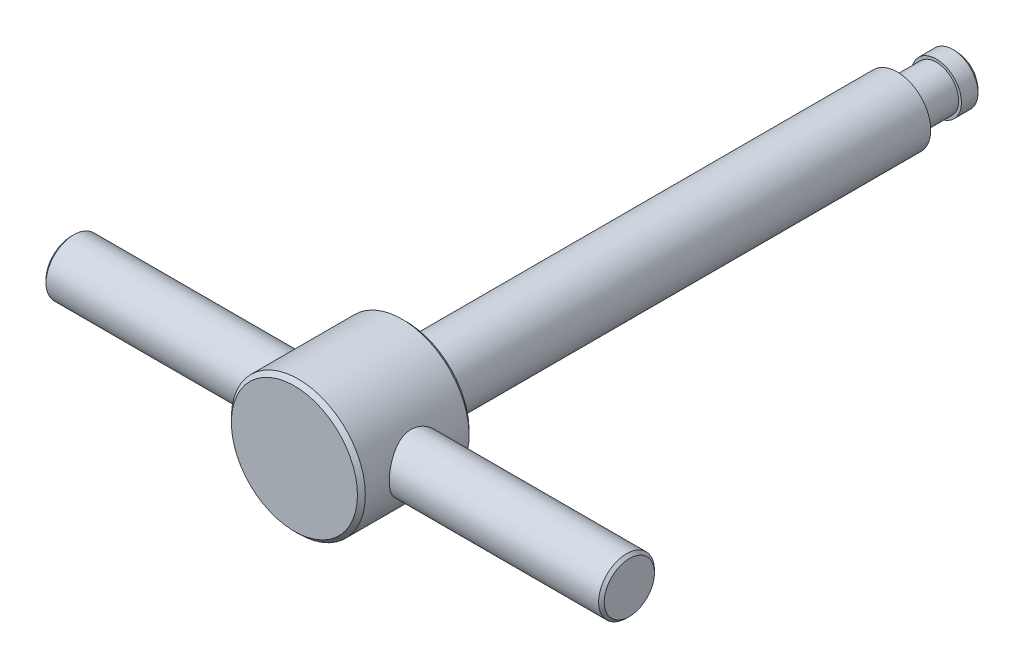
ISO-10303-21;
HEADER;
FILE_DESCRIPTION(('STEP AP214'),'2;1');
FILE_NAME('part.step','',(''),(''),'','','');
FILE_SCHEMA(('AUTOMOTIVE_DESIGN { 1 0 10303 214 1 1 1 1 }'));
ENDSEC;
DATA;
#1=APPLICATION_CONTEXT('core data for automotive mechanical design processes');
#2=APPLICATION_PROTOCOL_DEFINITION('international standard','automotive_design',2000,#1);
#3=PRODUCT_CONTEXT('',#1,'mechanical');
#4=PRODUCT('Part','Part','',(#3));
#5=PRODUCT_RELATED_PRODUCT_CATEGORY('part','',(#4));
#6=PRODUCT_DEFINITION_FORMATION('','',#4);
#7=PRODUCT_DEFINITION_CONTEXT('part definition',#1,'design');
#8=PRODUCT_DEFINITION('design','',#6,#7);
#9=PRODUCT_DEFINITION_SHAPE('','',#8);
#10=(LENGTH_UNIT() NAMED_UNIT(*) SI_UNIT(.MILLI.,.METRE.));
#11=(NAMED_UNIT(*) PLANE_ANGLE_UNIT() SI_UNIT($,.RADIAN.));
#12=(NAMED_UNIT(*) SI_UNIT($,.STERADIAN.) SOLID_ANGLE_UNIT());
#13=UNCERTAINTY_MEASURE_WITH_UNIT(LENGTH_MEASURE(1.E-05),#10,'distance_accuracy_value','');
#14=(GEOMETRIC_REPRESENTATION_CONTEXT(3) GLOBAL_UNCERTAINTY_ASSIGNED_CONTEXT((#13)) GLOBAL_UNIT_ASSIGNED_CONTEXT((#10,
#11,#12)) REPRESENTATION_CONTEXT('',''));
#15=CARTESIAN_POINT('',(0.,0.,0.));
#16=DIRECTION('',(0.,0.,1.));
#17=DIRECTION('',(1.,0.,0.));
#18=AXIS2_PLACEMENT_3D('',#15,#16,#17);
#19=CARTESIAN_POINT('',(25.,0.,57.25));
#20=DIRECTION('',(-1.,0.,0.));
#21=DIRECTION('',(0.,-1.,0.));
#22=AXIS2_PLACEMENT_3D('',#19,#20,#21);
#23=PLANE('',#22);
#24=CARTESIAN_POINT('',(25.0000000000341,0.,55.));
#25=DIRECTION('',(-1.,0.,0.));
#26=DIRECTION('',(0.,-1.,0.));
#27=AXIS2_PLACEMENT_3D('',#24,#25,#26);
#28=CIRCLE('',#27,2.25000000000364);
#29=CARTESIAN_POINT('',(25.0000000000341,-2.25000000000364,55.));
#30=VERTEX_POINT('',#29);
#31=EDGE_CURVE('E15',#30,#30,#28,.T.);
#32=ORIENTED_EDGE('',*,*,#31,.F.);
#33=EDGE_LOOP('',(#32));
#34=FACE_BOUND('',#33,.T.);
#35=ADVANCED_FACE('F12',(#34),#23,.F.);
#36=CARTESIAN_POINT('',(-25.,0.,55.));
#37=DIRECTION('',(1.,0.,0.));
#38=DIRECTION('',(0.,1.,0.));
#39=AXIS2_PLACEMENT_3D('',#36,#37,#38);
#40=PLANE('',#39);
#41=CARTESIAN_POINT('',(-24.9999999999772,0.,55.));
#42=DIRECTION('',(1.,0.,0.));
#43=DIRECTION('',(0.,0.,1.));
#44=AXIS2_PLACEMENT_3D('',#41,#42,#43);
#45=CIRCLE('',#44,2.25000000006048);
#46=CARTESIAN_POINT('',(-24.9999999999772,0.,57.2500000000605));
#47=VERTEX_POINT('',#46);
#48=EDGE_CURVE('E133',#47,#47,#45,.T.);
#49=ORIENTED_EDGE('',*,*,#48,.F.);
#50=EDGE_LOOP('',(#49));
#51=FACE_BOUND('',#50,.T.);
#52=ADVANCED_FACE('F171',(#51),#40,.F.);
#53=CARTESIAN_POINT('',(0.,0.,3.));
#54=DIRECTION('',(-1.,0.,0.));
#55=DIRECTION('',(0.,1.,0.));
#56=AXIS2_PLACEMENT_3D('',#53,#54,#55);
#57=SPHERICAL_SURFACE('',#56,3.);
#58=CARTESIAN_POINT('',(0.,0.,1.01568651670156));
#59=DIRECTION('',(0.,0.,1.));
#60=DIRECTION('',(0.,-1.,0.));
#61=AXIS2_PLACEMENT_3D('',#58,#59,#60);
#62=CIRCLE('',#61,2.25);
#63=CARTESIAN_POINT('',(0.,-2.25,1.01568651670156));
#64=VERTEX_POINT('',#63);
#65=EDGE_CURVE('E126',#64,#64,#62,.T.);
#66=ORIENTED_EDGE('',*,*,#65,.F.);
#67=EDGE_LOOP('',(#66));
#68=FACE_BOUND('',#67,.T.);
#69=ADVANCED_FACE('F168',(#68),#57,.T.);
#70=CARTESIAN_POINT('',(24.7499999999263,0.,55.));
#71=DIRECTION('',(-1.,0.,0.));
#72=DIRECTION('',(0.,-1.,0.));
#73=AXIS2_PLACEMENT_3D('',#70,#71,#72);
#74=CONICAL_SURFACE('',#73,2.50000000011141,0.785398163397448);
#75=CARTESIAN_POINT('',(24.75,0.,55.));
#76=DIRECTION('',(-1.,0.,0.));
#77=DIRECTION('',(0.,-1.,0.));
#78=AXIS2_PLACEMENT_3D('',#75,#76,#77);
#79=CIRCLE('',#78,2.5);
#80=CARTESIAN_POINT('',(24.75,-2.5,55.));
#81=VERTEX_POINT('',#80);
#82=EDGE_CURVE('E124',#81,#81,#79,.T.);
#83=ORIENTED_EDGE('',*,*,#82,.F.);
#84=EDGE_LOOP('',(#83));
#85=FACE_BOUND('',#84,.T.);
#86=ORIENTED_EDGE('',*,*,#31,.T.);
#87=EDGE_LOOP('',(#86));
#88=FACE_BOUND('',#87,.T.);
#89=ADVANCED_FACE('F164',(#85,#88),#74,.T.);
#90=CARTESIAN_POINT('',(0.,0.,60.));
#91=DIRECTION('',(0.,0.,-1.));
#92=DIRECTION('',(0.,1.,0.));
#93=AXIS2_PLACEMENT_3D('',#90,#91,#92);
#94=PLANE('',#93);
#95=CARTESIAN_POINT('',(0.,0.,59.9999999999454));
#96=DIRECTION('',(0.,0.,-1.));
#97=DIRECTION('',(1.,0.,0.));
#98=AXIS2_PLACEMENT_3D('',#95,#96,#97);
#99=CIRCLE('',#98,5.64644660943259);
#100=CARTESIAN_POINT('',(5.64644660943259,0.,59.9999999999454));
#101=VERTEX_POINT('',#100);
#102=EDGE_CURVE('E121',#101,#101,#99,.T.);
#103=ORIENTED_EDGE('',*,*,#102,.F.);
#104=EDGE_LOOP('',(#103));
#105=FACE_BOUND('',#104,.T.);
#106=ADVANCED_FACE('F160',(#105),#94,.F.);
#107=CARTESIAN_POINT('',(-24.7499999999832,0.,55.));
#108=DIRECTION('',(1.,0.,0.));
#109=DIRECTION('',(0.,0.,1.));
#110=AXIS2_PLACEMENT_3D('',#107,#108,#109);
#111=CONICAL_SURFACE('',#110,2.50000000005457,0.785398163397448);
#112=ORIENTED_EDGE('',*,*,#48,.T.);
#113=EDGE_LOOP('',(#112));
#114=FACE_BOUND('',#113,.T.);
#115=CARTESIAN_POINT('',(-24.75,0.,55.));
#116=DIRECTION('',(-1.,0.,0.));
#117=DIRECTION('',(0.,-1.,0.));
#118=AXIS2_PLACEMENT_3D('',#115,#116,#117);
#119=CIRCLE('',#118,2.5);
#120=CARTESIAN_POINT('',(-24.75,-2.5,55.));
#121=VERTEX_POINT('',#120);
#122=EDGE_CURVE('E117',#121,#121,#119,.F.);
#123=ORIENTED_EDGE('',*,*,#122,.F.);
#124=EDGE_LOOP('',(#123));
#125=FACE_BOUND('',#124,.T.);
#126=ADVANCED_FACE('F154',(#114,#125),#111,.T.);
#127=CARTESIAN_POINT('',(0.,0.,0.));
#128=DIRECTION('',(0.,0.,1.));
#129=DIRECTION('',(0.,-1.,0.));
#130=AXIS2_PLACEMENT_3D('',#127,#128,#129);
#131=CYLINDRICAL_SURFACE('',#130,2.25);
#132=CARTESIAN_POINT('',(0.,0.,2.5));
#133=DIRECTION('',(0.,0.,1.));
#134=DIRECTION('',(0.,-1.,0.));
#135=AXIS2_PLACEMENT_3D('',#132,#133,#134);
#136=CIRCLE('',#135,2.25);
#137=CARTESIAN_POINT('',(0.,-2.25,2.5));
#138=VERTEX_POINT('',#137);
#139=EDGE_CURVE('E120',#138,#138,#136,.F.);
#140=ORIENTED_EDGE('',*,*,#139,.T.);
#141=EDGE_LOOP('',(#140));
#142=FACE_BOUND('',#141,.T.);
#143=ORIENTED_EDGE('',*,*,#65,.T.);
#144=EDGE_LOOP('',(#143));
#145=FACE_BOUND('',#144,.T.);
#146=ADVANCED_FACE('F147',(#142,#145),#131,.T.);
#147=CARTESIAN_POINT('',(25.,0.,55.));
#148=DIRECTION('',(-1.,0.,0.));
#149=DIRECTION('',(0.,-1.,0.));
#150=AXIS2_PLACEMENT_3D('',#147,#148,#149);
#151=CYLINDRICAL_SURFACE('',#150,2.5);
#152=CARTESIAN_POINT('',(5.45579342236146,2.49686165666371,54.8747727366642));
#153=CARTESIAN_POINT('',(5.4573407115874,2.49348212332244,54.807420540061));
#154=CARTESIAN_POINT('',(5.46013427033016,2.48737499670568,54.7402107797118));
#155=CARTESIAN_POINT('',(5.46811434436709,2.46977965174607,54.6066293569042));
#156=CARTESIAN_POINT('',(5.47330241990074,2.45828792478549,54.5402582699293));
#157=CARTESIAN_POINT('',(5.49224376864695,2.41583552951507,54.3428594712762));
#158=CARTESIAN_POINT('',(5.50936824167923,2.37690915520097,54.2137675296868));
#159=CARTESIAN_POINT('',(5.55031554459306,2.27963408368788,53.96507761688));
#160=CARTESIAN_POINT('',(5.57410899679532,2.22137036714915,53.8454408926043));
#161=CARTESIAN_POINT('',(5.6257284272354,2.08718411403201,53.6175612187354));
#162=CARTESIAN_POINT('',(5.65355320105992,2.01126684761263,53.5093148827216));
#163=CARTESIAN_POINT('',(5.71212107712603,1.838599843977,53.3002953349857));
#164=CARTESIAN_POINT('',(5.74293951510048,1.74088566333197,53.2003391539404));
#165=CARTESIAN_POINT('',(5.80272734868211,1.52982934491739,53.0178063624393));
#166=CARTESIAN_POINT('',(5.83169618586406,1.41648251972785,52.935234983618));
#167=CARTESIAN_POINT('',(5.88545947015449,1.1735507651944,52.7878805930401));
#168=CARTESIAN_POINT('',(5.91012490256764,1.04361863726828,52.7236193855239));
#169=CARTESIAN_POINT('',(5.95149690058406,0.773502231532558,52.618261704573));
#170=CARTESIAN_POINT('',(5.96820776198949,0.633323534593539,52.5771527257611));
#171=CARTESIAN_POINT('',(5.9909398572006,0.35605350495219,52.521703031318));
#172=CARTESIAN_POINT('',(5.99756148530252,0.219312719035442,52.5058559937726));
#173=CARTESIAN_POINT('',(6.00131386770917,-0.0550255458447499,52.4968437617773));
#174=CARTESIAN_POINT('',(5.99844751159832,-0.192622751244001,52.5036716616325));
#175=CARTESIAN_POINT('',(5.98393790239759,-0.457365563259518,52.5387520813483));
#176=CARTESIAN_POINT('',(5.97274986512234,-0.584686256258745,52.5658938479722));
#177=CARTESIAN_POINT('',(5.94323412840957,-0.832820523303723,52.639246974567));
#178=CARTESIAN_POINT('',(5.92490555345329,-0.953633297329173,52.6854606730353));
#179=CARTESIAN_POINT('',(5.88219611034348,-1.18934663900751,52.7970564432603));
#180=CARTESIAN_POINT('',(5.85765314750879,-1.30396896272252,52.8629621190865));
#181=CARTESIAN_POINT('',(5.80510670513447,-1.5209261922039,53.0115115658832));
#182=CARTESIAN_POINT('',(5.77710180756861,-1.62325602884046,53.0941622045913));
#183=CARTESIAN_POINT('',(5.7181615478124,-1.82042970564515,53.2807700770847));
#184=CARTESIAN_POINT('',(5.68715988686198,-1.91421389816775,53.3858287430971));
#185=CARTESIAN_POINT('',(5.62748515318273,-2.08313617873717,53.6106412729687));
#186=CARTESIAN_POINT('',(5.5988126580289,-2.158269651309,53.7303987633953));
#187=CARTESIAN_POINT('',(5.5467737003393,-2.28874133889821,53.983972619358));
#188=CARTESIAN_POINT('',(5.52350201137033,-2.34373455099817,54.1179874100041));
#189=CARTESIAN_POINT('',(5.48614157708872,-2.42991688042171,54.3946484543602));
#190=CARTESIAN_POINT('',(5.47204533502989,-2.46112543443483,54.5372875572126));
#191=CARTESIAN_POINT('',(5.45584469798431,-2.49681994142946,54.8154885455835));
#192=CARTESIAN_POINT('',(5.4529112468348,-2.50315453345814,54.9507657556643));
#193=CARTESIAN_POINT('',(5.45714355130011,-2.49391503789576,55.2203941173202));
#194=CARTESIAN_POINT('',(5.46430755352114,-2.47834475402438,55.354745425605));
#195=CARTESIAN_POINT('',(5.48715188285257,-2.42731941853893,55.6119498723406));
#196=CARTESIAN_POINT('',(5.50240078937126,-2.39286895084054,55.735044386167));
#197=CARTESIAN_POINT('',(5.53933217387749,-2.30608126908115,55.9737173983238));
#198=CARTESIAN_POINT('',(5.56101634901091,-2.25373933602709,56.0892939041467));
#199=CARTESIAN_POINT('',(5.60994281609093,-2.12914601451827,56.3170249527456));
#200=CARTESIAN_POINT('',(5.63743552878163,-2.05591142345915,56.4285866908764));
#201=CARTESIAN_POINT('',(5.69422833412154,-1.89293576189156,56.6384323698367));
#202=CARTESIAN_POINT('',(5.72352923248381,-1.80318729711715,56.7367103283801));
#203=CARTESIAN_POINT('',(5.78324662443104,-1.60183297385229,56.9247009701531));
#204=CARTESIAN_POINT('',(5.81358445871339,-1.48909911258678,57.0132361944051));
#205=CARTESIAN_POINT('',(5.86977338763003,-1.24935837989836,57.170165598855));
#206=CARTESIAN_POINT('',(5.89562488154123,-1.12235278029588,57.238561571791));
#207=CARTESIAN_POINT('',(5.93960982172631,-0.859369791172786,57.3519483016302));
#208=CARTESIAN_POINT('',(5.957855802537,-0.723560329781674,57.3972826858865));
#209=CARTESIAN_POINT('',(5.98507884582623,-0.445333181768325,57.4641664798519));
#210=CARTESIAN_POINT('',(5.9940612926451,-0.302919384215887,57.4857297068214));
#211=CARTESIAN_POINT('',(6.00141926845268,-0.0265470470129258,57.5034141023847));
#212=CARTESIAN_POINT('',(6.00050937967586,0.107285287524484,57.5012491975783));
#213=CARTESIAN_POINT('',(5.9898940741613,0.37253240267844,57.4756750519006));
#214=CARTESIAN_POINT('',(5.9801894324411,0.503947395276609,57.4522676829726));
#215=CARTESIAN_POINT('',(5.95328590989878,0.757865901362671,57.3858967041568));
#216=CARTESIAN_POINT('',(5.9362510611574,0.880499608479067,57.3433602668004));
#217=CARTESIAN_POINT('',(5.89634089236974,1.11694067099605,57.2403317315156));
#218=CARTESIAN_POINT('',(5.87346418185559,1.23074591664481,57.1798353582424));
#219=CARTESIAN_POINT('',(5.82254236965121,1.45318208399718,57.0387641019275));
#220=CARTESIAN_POINT('',(5.79428057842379,1.56117318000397,56.9572596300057));
#221=CARTESIAN_POINT('',(5.73626589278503,1.76245406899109,56.7781790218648));
#222=CARTESIAN_POINT('',(5.70651242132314,1.85573811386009,56.6805966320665));
#223=CARTESIAN_POINT('',(5.64665744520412,2.03084981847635,56.4649560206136));
#224=CARTESIAN_POINT('',(5.6166475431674,2.11161682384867,56.346006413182));
#225=CARTESIAN_POINT('',(5.56184611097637,2.25201465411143,56.095042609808));
#226=CARTESIAN_POINT('',(5.53705640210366,2.31163810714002,55.9630238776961));
#227=CARTESIAN_POINT('',(5.4965798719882,2.40629255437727,55.6926166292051));
#228=CARTESIAN_POINT('',(5.48068775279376,2.44188246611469,55.5544588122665));
#229=CARTESIAN_POINT('',(5.46473916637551,2.47724918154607,55.343969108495));
#230=CARTESIAN_POINT('',(5.46073796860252,2.48603523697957,55.2733305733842));
#231=CARTESIAN_POINT('',(5.45548244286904,2.49755101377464,55.1314756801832));
#232=CARTESIAN_POINT('',(5.45422615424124,2.50028505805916,55.060259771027));
#233=CARTESIAN_POINT('',(5.45444241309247,2.49981071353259,54.9509592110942));
#234=CARTESIAN_POINT('',(5.4549188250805,2.49877192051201,54.9128432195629));
#235=CARTESIAN_POINT('',(5.45579342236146,2.49686165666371,54.8747727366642));
#236=B_SPLINE_CURVE_WITH_KNOTS('',3,(#152,#153,#154,#155,#156,#157,#158,#159,#160,#161,#162,
#163,#164,#165,#166,#167,#168,#169,#170,#171,#172,#173,#174,#175,#176,#177,#178,#179,#180,#181,
#182,#183,#184,#185,#186,#187,#188,#189,#190,#191,#192,#193,#194,#195,#196,#197,#198,#199,#200,
#201,#202,#203,#204,#205,#206,#207,#208,#209,#210,#211,#212,#213,#214,#215,#216,#217,#218,#219,
#220,#221,#222,#223,#224,#225,#226,#227,#228,#229,#230,#231,#232,#233,#234,#235),.UNSPECIFIED.,
.T.,.F.,(4,2,2,2,2,2,2,2,2,2,2,2,2,2,2,2,2,2,2,2,2,2,2,2,2,2,2,2,2,2,2,2,2,2,2,2,2,2,2,2,2,4),
(0.,0.202330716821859,0.404793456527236,0.810374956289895,1.2141971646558,1.61789897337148,
2.04540544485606,2.47304038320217,2.91186134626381,3.35044505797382,3.76174116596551,
4.1729120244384,4.56310688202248,4.95334959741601,5.35506542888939,5.75694635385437,
6.18758470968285,6.61832952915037,7.05614152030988,7.49359534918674,7.89784284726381,
8.30202015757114,8.68652786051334,9.07113705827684,9.47817972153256,9.88540508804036,
10.3228612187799,10.7602783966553,11.1909715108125,11.6214141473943,12.0209827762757,
12.4205161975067,12.8115394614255,13.202655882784,13.6155254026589,14.0285558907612,
14.4670464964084,14.9056898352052,15.3337443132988,15.547376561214,15.7608561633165,
15.8752225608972),.UNSPECIFIED.);
#237=CARTESIAN_POINT('',(5.45579342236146,2.49686165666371,54.8747727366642));
#238=VERTEX_POINT('',#237);
#239=EDGE_CURVE('E46',#238,#238,#236,.T.);
#240=ORIENTED_EDGE('',*,*,#239,.F.);
#241=EDGE_LOOP('',(#240));
#242=FACE_BOUND('',#241,.T.);
#243=ORIENTED_EDGE('',*,*,#82,.T.);
#244=EDGE_LOOP('',(#243));
#245=FACE_BOUND('',#244,.T.);
#246=ADVANCED_FACE('F145',(#242,#245),#151,.T.);
#247=CARTESIAN_POINT('',(0.,0.,59.6464466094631));
#248=DIRECTION('',(0.,0.,-1.));
#249=DIRECTION('',(1.,0.,0.));
#250=AXIS2_PLACEMENT_3D('',#247,#248,#249);
#251=CONICAL_SURFACE('',#250,5.99999999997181,0.785398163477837);
#252=ORIENTED_EDGE('',*,*,#102,.T.);
#253=EDGE_LOOP('',(#252));
#254=FACE_BOUND('',#253,.T.);
#255=CARTESIAN_POINT('',(0.,0.,59.6464466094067));
#256=DIRECTION('',(0.,0.,1.));
#257=DIRECTION('',(0.,-1.,0.));
#258=AXIS2_PLACEMENT_3D('',#255,#256,#257);
#259=CIRCLE('',#258,6.);
#260=CARTESIAN_POINT('',(0.,-6.,59.6464466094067));
#261=VERTEX_POINT('',#260);
#262=EDGE_CURVE('E45',#261,#261,#259,.F.);
#263=ORIENTED_EDGE('',*,*,#262,.F.);
#264=EDGE_LOOP('',(#263));
#265=FACE_BOUND('',#264,.T.);
#266=ADVANCED_FACE('F72',(#254,#265),#251,.T.);
#267=CARTESIAN_POINT('',(25.,0.,55.));
#268=DIRECTION('',(-1.,0.,0.));
#269=DIRECTION('',(0.,-1.,0.));
#270=AXIS2_PLACEMENT_3D('',#267,#268,#269);
#271=CYLINDRICAL_SURFACE('',#270,2.5);
#272=ORIENTED_EDGE('',*,*,#122,.T.);
#273=EDGE_LOOP('',(#272));
#274=FACE_BOUND('',#273,.T.);
#275=CARTESIAN_POINT('',(-5.45579342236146,2.49686165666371,55.1252272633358));
#276=CARTESIAN_POINT('',(-5.4573407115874,2.49348212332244,55.192579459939));
#277=CARTESIAN_POINT('',(-5.46013427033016,2.48737499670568,55.2597892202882));
#278=CARTESIAN_POINT('',(-5.4681143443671,2.46977965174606,55.3933706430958));
#279=CARTESIAN_POINT('',(-5.47330241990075,2.45828792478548,55.4597417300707));
#280=CARTESIAN_POINT('',(-5.49224376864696,2.41583552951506,55.6571405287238));
#281=CARTESIAN_POINT('',(-5.50936824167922,2.37690915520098,55.7862324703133));
#282=CARTESIAN_POINT('',(-5.55031554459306,2.27963408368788,56.03492238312));
#283=CARTESIAN_POINT('',(-5.57410899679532,2.22137036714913,56.1545591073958));
#284=CARTESIAN_POINT('',(-5.6257284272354,2.08718411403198,56.3824387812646));
#285=CARTESIAN_POINT('',(-5.65355320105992,2.01126684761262,56.4906851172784));
#286=CARTESIAN_POINT('',(-5.71212107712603,1.83859984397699,56.6997046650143));
#287=CARTESIAN_POINT('',(-5.74293951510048,1.74088566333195,56.7996608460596));
#288=CARTESIAN_POINT('',(-5.80272734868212,1.52982934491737,56.9821936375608));
#289=CARTESIAN_POINT('',(-5.83169618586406,1.41648251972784,57.0647650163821));
#290=CARTESIAN_POINT('',(-5.88545947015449,1.1735507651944,57.21211940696));
#291=CARTESIAN_POINT('',(-5.91012490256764,1.04361863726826,57.2763806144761));
#292=CARTESIAN_POINT('',(-5.95149690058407,0.773502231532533,57.381738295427));
#293=CARTESIAN_POINT('',(-5.96820776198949,0.633323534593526,57.4228472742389));
#294=CARTESIAN_POINT('',(-5.9909398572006,0.356053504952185,57.478296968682));
#295=CARTESIAN_POINT('',(-5.99756148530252,0.219312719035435,57.4941440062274));
#296=CARTESIAN_POINT('',(-6.00131386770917,-0.0550255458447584,57.5031562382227));
#297=CARTESIAN_POINT('',(-5.99844751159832,-0.192622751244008,57.4963283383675));
#298=CARTESIAN_POINT('',(-5.98393790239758,-0.457365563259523,57.4612479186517));
#299=CARTESIAN_POINT('',(-5.97274986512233,-0.58468625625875,57.4341061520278));
#300=CARTESIAN_POINT('',(-5.94323412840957,-0.832820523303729,57.360753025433));
#301=CARTESIAN_POINT('',(-5.92490555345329,-0.95363329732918,57.3145393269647));
#302=CARTESIAN_POINT('',(-5.88219611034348,-1.18934663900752,57.2029435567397));
#303=CARTESIAN_POINT('',(-5.85765314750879,-1.30396896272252,57.1370378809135));
#304=CARTESIAN_POINT('',(-5.80510670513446,-1.5209261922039,56.9884884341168));
#305=CARTESIAN_POINT('',(-5.77710180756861,-1.62325602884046,56.9058377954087));
#306=CARTESIAN_POINT('',(-5.71816154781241,-1.82042970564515,56.7192299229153));
#307=CARTESIAN_POINT('',(-5.68715988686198,-1.91421389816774,56.6141712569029));
#308=CARTESIAN_POINT('',(-5.62748515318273,-2.08313617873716,56.3893587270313));
#309=CARTESIAN_POINT('',(-5.5988126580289,-2.158269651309,56.2696012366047));
#310=CARTESIAN_POINT('',(-5.5467737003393,-2.28874133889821,56.016027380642));
#311=CARTESIAN_POINT('',(-5.52350201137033,-2.34373455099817,55.8820125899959));
#312=CARTESIAN_POINT('',(-5.48614157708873,-2.42991688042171,55.6053515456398));
#313=CARTESIAN_POINT('',(-5.47204533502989,-2.46112543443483,55.4627124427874));
#314=CARTESIAN_POINT('',(-5.45584469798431,-2.49681994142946,55.1845114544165));
#315=CARTESIAN_POINT('',(-5.4529112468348,-2.50315453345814,55.0492342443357));
#316=CARTESIAN_POINT('',(-5.45714355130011,-2.49391503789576,54.7796058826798));
#317=CARTESIAN_POINT('',(-5.46430755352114,-2.47834475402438,54.645254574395));
#318=CARTESIAN_POINT('',(-5.48715188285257,-2.42731941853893,54.3880501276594));
#319=CARTESIAN_POINT('',(-5.50240078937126,-2.39286895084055,54.264955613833));
#320=CARTESIAN_POINT('',(-5.53933217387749,-2.30608126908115,54.0262826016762));
#321=CARTESIAN_POINT('',(-5.56101634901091,-2.25373933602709,53.9107060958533));
#322=CARTESIAN_POINT('',(-5.60994281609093,-2.12914601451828,53.6829750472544));
#323=CARTESIAN_POINT('',(-5.63743552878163,-2.05591142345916,53.5714133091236));
#324=CARTESIAN_POINT('',(-5.69422833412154,-1.89293576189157,53.3615676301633));
#325=CARTESIAN_POINT('',(-5.72352923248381,-1.80318729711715,53.2632896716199));
#326=CARTESIAN_POINT('',(-5.78324662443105,-1.60183297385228,53.0752990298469));
#327=CARTESIAN_POINT('',(-5.81358445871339,-1.48909911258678,52.9867638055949));
#328=CARTESIAN_POINT('',(-5.86977338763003,-1.24935837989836,52.829834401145));
#329=CARTESIAN_POINT('',(-5.89562488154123,-1.12235278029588,52.761438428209));
#330=CARTESIAN_POINT('',(-5.93960982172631,-0.859369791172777,52.6480516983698));
#331=CARTESIAN_POINT('',(-5.95785580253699,-0.723560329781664,52.6027173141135));
#332=CARTESIAN_POINT('',(-5.98507884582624,-0.445333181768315,52.5358335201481));
#333=CARTESIAN_POINT('',(-5.99406129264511,-0.302919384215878,52.5142702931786));
#334=CARTESIAN_POINT('',(-6.00141926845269,-0.0265470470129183,52.4965858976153));
#335=CARTESIAN_POINT('',(-6.00050937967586,0.107285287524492,52.4987508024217));
#336=CARTESIAN_POINT('',(-5.9898940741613,0.372532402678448,52.5243249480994));
#337=CARTESIAN_POINT('',(-5.9801894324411,0.503947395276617,52.5477323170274));
#338=CARTESIAN_POINT('',(-5.95328590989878,0.757865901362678,52.6141032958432));
#339=CARTESIAN_POINT('',(-5.9362510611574,0.880499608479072,52.6566397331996));
#340=CARTESIAN_POINT('',(-5.89634089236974,1.11694067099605,52.7596682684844));
#341=CARTESIAN_POINT('',(-5.87346418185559,1.23074591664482,52.8201646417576));
#342=CARTESIAN_POINT('',(-5.82254236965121,1.45318208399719,52.9612358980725));
#343=CARTESIAN_POINT('',(-5.79428057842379,1.56117318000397,53.0427403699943));
#344=CARTESIAN_POINT('',(-5.73626589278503,1.76245406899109,53.2218209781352));
#345=CARTESIAN_POINT('',(-5.70651242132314,1.85573811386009,53.3194033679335));
#346=CARTESIAN_POINT('',(-5.64665744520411,2.03084981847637,53.5350439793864));
#347=CARTESIAN_POINT('',(-5.6166475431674,2.1116168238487,53.653993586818));
#348=CARTESIAN_POINT('',(-5.56184611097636,2.25201465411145,53.904957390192));
#349=CARTESIAN_POINT('',(-5.53705640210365,2.31163810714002,54.036976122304));
#350=CARTESIAN_POINT('',(-5.4965798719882,2.40629255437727,54.307383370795));
#351=CARTESIAN_POINT('',(-5.48068775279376,2.4418824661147,54.4455411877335));
#352=CARTESIAN_POINT('',(-5.4647391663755,2.47724918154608,54.6560308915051));
#353=CARTESIAN_POINT('',(-5.46073796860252,2.48603523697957,54.7266694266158));
#354=CARTESIAN_POINT('',(-5.45548244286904,2.49755101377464,54.8685243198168));
#355=CARTESIAN_POINT('',(-5.45422615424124,2.50028505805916,54.9397402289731));
#356=CARTESIAN_POINT('',(-5.45444241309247,2.49981071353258,55.0490407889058));
#357=CARTESIAN_POINT('',(-5.4549188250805,2.49877192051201,55.0871567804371));
#358=CARTESIAN_POINT('',(-5.45579342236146,2.49686165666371,55.1252272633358));
#359=B_SPLINE_CURVE_WITH_KNOTS('',3,(#275,#276,#277,#278,#279,#280,#281,#282,#283,#284,#285,
#286,#287,#288,#289,#290,#291,#292,#293,#294,#295,#296,#297,#298,#299,#300,#301,#302,#303,#304,
#305,#306,#307,#308,#309,#310,#311,#312,#313,#314,#315,#316,#317,#318,#319,#320,#321,#322,#323,
#324,#325,#326,#327,#328,#329,#330,#331,#332,#333,#334,#335,#336,#337,#338,#339,#340,#341,#342,
#343,#344,#345,#346,#347,#348,#349,#350,#351,#352,#353,#354,#355,#356,#357,#358),.UNSPECIFIED.,
.T.,.F.,(4,2,2,2,2,2,2,2,2,2,2,2,2,2,2,2,2,2,2,2,2,2,2,2,2,2,2,2,2,2,2,2,2,2,2,2,2,2,2,2,2,4),
(0.,0.20233071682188,0.404793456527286,0.810374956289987,1.21419716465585,1.61789897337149,
2.0454054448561,2.47304038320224,2.91186134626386,3.35044505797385,3.76174116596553,
4.17291202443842,4.5631068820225,4.95334959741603,5.35506542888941,5.75694635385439,
6.18758470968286,6.61832952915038,7.05614152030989,7.49359534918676,7.89784284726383,
8.30202015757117,8.68652786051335,9.07113705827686,9.47817972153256,9.88540508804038,
10.3228612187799,10.7602783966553,11.1909715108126,11.6214141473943,12.0209827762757,
12.4205161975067,12.8115394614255,13.202655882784,13.6155254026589,14.0285558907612,
14.4670464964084,14.9056898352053,15.3337443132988,15.547376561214,15.7608561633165,
15.8752225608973),.UNSPECIFIED.);
#360=CARTESIAN_POINT('',(-5.45579342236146,2.49686165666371,55.1252272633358));
#361=VERTEX_POINT('',#360);
#362=EDGE_CURVE('E37',#361,#361,#359,.T.);
#363=ORIENTED_EDGE('',*,*,#362,.F.);
#364=EDGE_LOOP('',(#363));
#365=FACE_BOUND('',#364,.T.);
#366=ADVANCED_FACE('F52',(#274,#365),#271,.T.);
#367=CARTESIAN_POINT('',(2.,0.,2.5));
#368=DIRECTION('',(0.,0.,-1.));
#369=DIRECTION('',(0.,1.,0.));
#370=AXIS2_PLACEMENT_3D('',#367,#368,#369);
#371=PLANE('',#370);
#372=CARTESIAN_POINT('',(0.,0.,2.5));
#373=DIRECTION('',(0.,0.,1.));
#374=DIRECTION('',(0.,-1.,0.));
#375=AXIS2_PLACEMENT_3D('',#372,#373,#374);
#376=CIRCLE('',#375,2.);
#377=CARTESIAN_POINT('',(0.,-2.,2.5));
#378=VERTEX_POINT('',#377);
#379=EDGE_CURVE('E33',#378,#378,#376,.T.);
#380=ORIENTED_EDGE('',*,*,#379,.F.);
#381=EDGE_LOOP('',(#380));
#382=FACE_BOUND('',#381,.T.);
#383=ORIENTED_EDGE('',*,*,#139,.F.);
#384=EDGE_LOOP('',(#383));
#385=FACE_BOUND('',#384,.T.);
#386=ADVANCED_FACE('F61',(#382,#385),#371,.F.);
#387=CARTESIAN_POINT('',(0.,0.,0.));
#388=DIRECTION('',(0.,0.,1.));
#389=DIRECTION('',(0.,-1.,0.));
#390=AXIS2_PLACEMENT_3D('',#387,#388,#389);
#391=CYLINDRICAL_SURFACE('',#390,6.);
#392=ORIENTED_EDGE('',*,*,#362,.T.);
#393=EDGE_LOOP('',(#392));
#394=FACE_BOUND('',#393,.T.);
#395=ORIENTED_EDGE('',*,*,#262,.T.);
#396=EDGE_LOOP('',(#395));
#397=FACE_BOUND('',#396,.T.);
#398=ORIENTED_EDGE('',*,*,#239,.T.);
#399=EDGE_LOOP('',(#398));
#400=FACE_BOUND('',#399,.T.);
#401=CARTESIAN_POINT('',(0.,0.,50.3535533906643));
#402=DIRECTION('',(0.,0.,1.));
#403=DIRECTION('',(0.,-1.,0.));
#404=AXIS2_PLACEMENT_3D('',#401,#402,#403);
#405=CIRCLE('',#404,5.99999999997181);
#406=CARTESIAN_POINT('',(0.,-5.99999999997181,50.3535533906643));
#407=VERTEX_POINT('',#406);
#408=EDGE_CURVE('E36',#407,#407,#405,.F.);
#409=ORIENTED_EDGE('',*,*,#408,.F.);
#410=EDGE_LOOP('',(#409));
#411=FACE_BOUND('',#410,.T.);
#412=ADVANCED_FACE('F56',(#394,#397,#400,#411),#391,.T.);
#413=CARTESIAN_POINT('',(0.,0.,0.));
#414=DIRECTION('',(0.,0.,1.));
#415=DIRECTION('',(0.,-1.,0.));
#416=AXIS2_PLACEMENT_3D('',#413,#414,#415);
#417=CYLINDRICAL_SURFACE('',#416,2.);
#418=CARTESIAN_POINT('',(0.,0.,5.42264973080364));
#419=DIRECTION('',(0.,0.,1.));
#420=DIRECTION('',(0.,-1.,0.));
#421=AXIS2_PLACEMENT_3D('',#418,#419,#420);
#422=CIRCLE('',#421,2.00000000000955);
#423=CARTESIAN_POINT('',(0.,-2.00000000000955,5.42264973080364));
#424=VERTEX_POINT('',#423);
#425=EDGE_CURVE('E32',#424,#424,#422,.T.);
#426=ORIENTED_EDGE('',*,*,#425,.F.);
#427=EDGE_LOOP('',(#426));
#428=FACE_BOUND('',#427,.T.);
#429=ORIENTED_EDGE('',*,*,#379,.T.);
#430=EDGE_LOOP('',(#429));
#431=FACE_BOUND('',#430,.T.);
#432=ADVANCED_FACE('F60',(#428,#431),#417,.T.);
#433=CARTESIAN_POINT('',(0.,0.,50.3535533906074));
#434=DIRECTION('',(0.,0.,1.));
#435=DIRECTION('',(0.,-1.,0.));
#436=AXIS2_PLACEMENT_3D('',#433,#434,#435);
#437=CONICAL_SURFACE('',#436,5.99999999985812,0.785398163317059);
#438=ORIENTED_EDGE('',*,*,#408,.T.);
#439=EDGE_LOOP('',(#438));
#440=FACE_BOUND('',#439,.T.);
#441=CARTESIAN_POINT('',(0.,0.,50.0000000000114));
#442=DIRECTION('',(0.,0.,1.));
#443=DIRECTION('',(0.,-1.,0.));
#444=AXIS2_PLACEMENT_3D('',#441,#442,#443);
#445=CIRCLE('',#444,5.6464466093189);
#446=CARTESIAN_POINT('',(0.,-5.6464466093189,50.0000000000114));
#447=VERTEX_POINT('',#446);
#448=EDGE_CURVE('E24',#447,#447,#445,.T.);
#449=ORIENTED_EDGE('',*,*,#448,.T.);
#450=EDGE_LOOP('',(#449));
#451=FACE_BOUND('',#450,.T.);
#452=ADVANCED_FACE('F90',(#440,#451),#437,.T.);
#453=CARTESIAN_POINT('',(0.,0.,5.99999999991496));
#454=DIRECTION('',(0.,0.,1.));
#455=DIRECTION('',(-1.,0.,0.));
#456=AXIS2_PLACEMENT_3D('',#453,#454,#455);
#457=CONICAL_SURFACE('',#456,2.99999999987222,1.04719755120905);
#458=CARTESIAN_POINT('',(0.,0.,6.));
#459=DIRECTION('',(0.,0.,1.));
#460=DIRECTION('',(0.,-1.,0.));
#461=AXIS2_PLACEMENT_3D('',#458,#459,#460);
#462=CIRCLE('',#461,3.);
#463=CARTESIAN_POINT('',(0.,-3.,6.));
#464=VERTEX_POINT('',#463);
#465=EDGE_CURVE('E19',#464,#464,#462,.T.);
#466=ORIENTED_EDGE('',*,*,#465,.F.);
#467=EDGE_LOOP('',(#466));
#468=FACE_BOUND('',#467,.T.);
#469=ORIENTED_EDGE('',*,*,#425,.T.);
#470=EDGE_LOOP('',(#469));
#471=FACE_BOUND('',#470,.T.);
#472=ADVANCED_FACE('F84',(#468,#471),#457,.T.);
#473=CARTESIAN_POINT('',(5.64644660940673,0.,50.));
#474=DIRECTION('',(0.,0.,1.));
#475=DIRECTION('',(0.,-1.,0.));
#476=AXIS2_PLACEMENT_3D('',#473,#474,#475);
#477=PLANE('',#476);
#478=ORIENTED_EDGE('',*,*,#448,.F.);
#479=EDGE_LOOP('',(#478));
#480=FACE_BOUND('',#479,.T.);
#481=CARTESIAN_POINT('',(0.,0.,50.));
#482=DIRECTION('',(0.,0.,1.));
#483=DIRECTION('',(0.,-1.,0.));
#484=AXIS2_PLACEMENT_3D('',#481,#482,#483);
#485=CIRCLE('',#484,3.);
#486=CARTESIAN_POINT('',(0.,-3.,50.));
#487=VERTEX_POINT('',#486);
#488=EDGE_CURVE('E8',#487,#487,#485,.F.);
#489=ORIENTED_EDGE('',*,*,#488,.F.);
#490=EDGE_LOOP('',(#489));
#491=FACE_BOUND('',#490,.T.);
#492=ADVANCED_FACE('F78',(#480,#491),#477,.F.);
#493=CARTESIAN_POINT('',(0.,0.,0.));
#494=DIRECTION('',(0.,0.,1.));
#495=DIRECTION('',(0.,-1.,0.));
#496=AXIS2_PLACEMENT_3D('',#493,#494,#495);
#497=CYLINDRICAL_SURFACE('',#496,3.);
#498=ORIENTED_EDGE('',*,*,#488,.T.);
#499=EDGE_LOOP('',(#498));
#500=FACE_BOUND('',#499,.T.);
#501=ORIENTED_EDGE('',*,*,#465,.T.);
#502=EDGE_LOOP('',(#501));
#503=FACE_BOUND('',#502,.T.);
#504=ADVANCED_FACE('F76',(#500,#503),#497,.T.);
#505=CLOSED_SHELL('',(#35,#52,#69,#89,#106,#126,#146,#246,#266,#366,#386,#412,#432,#452,#472,
#492,#504));
#506=MANIFOLD_SOLID_BREP('B1',#505);
#507=ADVANCED_BREP_SHAPE_REPRESENTATION('',(#18,#506),#14);
#508=SHAPE_DEFINITION_REPRESENTATION(#9,#507);
ENDSEC;
END-ISO-10303-21;
